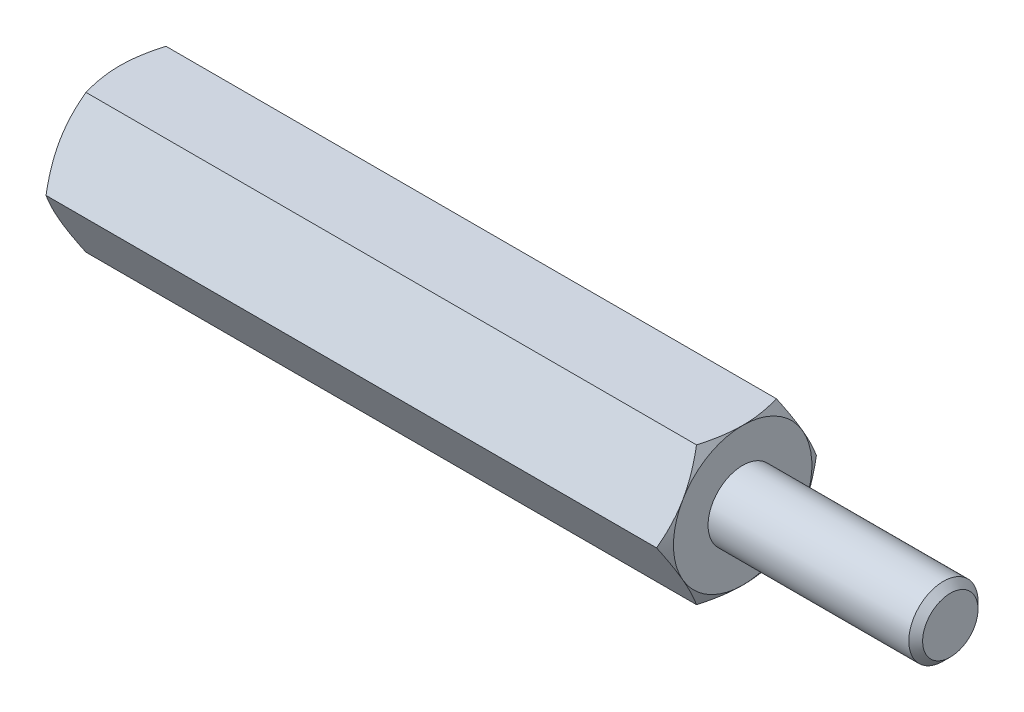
from build123d import *

# Parameters (mm, degrees)
EXTRUDE2_DEPTH = 9
SKETCH3_R      = 0.8
EXTRUDE3_DEPTH = 6
SKETCH5_R      = 1
EXTRUDE4_DEPTH = 6
CHAMFER1_SIZE  = 0.2


with BuildPart() as part:
    # Sketch1 → Extrude2 (new, symmetric)
    with BuildSketch(Plane(origin=(0, 0, 0), x_dir=(0, 0, -1), z_dir=(1, 0, 0))):
        Polygon((1.154700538, 2), (-1.154700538, 2), (-2.309401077, 0), (-1.154700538, -2), (1.154700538, -2), (2.309401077, 0), align=None)
    extrude(amount=EXTRUDE2_DEPTH, both=True)

    # Sketch2 → Cut-Revolve1 (revolve, cut)
    with BuildSketch(Plane.XY):
        with BuildLine():
            Line((-9, 2), (-7.5, 4.598076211))
            ThreePointArc((-7.5, 4.598076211), (-7.98810136, 5.776457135), (-9, 5))
            Line((-9, 5), (-9, 2))
        make_face()
    cut_revolve1 = revolve(axis=Axis((0, 0, 0), (1, 0, 0)), mode=Mode.SUBTRACT)

    # Mirror1: Cut-Revolve1 across plane
    add(cut_revolve1.mirror(Plane(origin=(0, 0, 0), x_dir=(0, 0, 1), z_dir=(1, 0, 0))), mode=Mode.SUBTRACT)

    # Sketch3 → Extrude3 (cut)
    with BuildSketch(Plane.ZY.offset(9)):
        Circle(SKETCH3_R)
    extrude(amount=-EXTRUDE3_DEPTH, mode=Mode.SUBTRACT)

    # Sketch4 → Cut-Revolve2 (revolve, cut)
    with BuildSketch(Plane.XY, mode=Mode.PRIVATE) as cut_revolve2_sk:
        Polygon((-3, 0), (-3, 0.8), (-2.538119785, 0), align=None)
    revolve(cut_revolve2_sk.sketch.rotate(Axis((-2.538119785, 0, 0), (-1, 0, 0)), 180), axis=Axis((-2.538119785, 0, 0), (-1, 0, 0)), mode=Mode.SUBTRACT)

    # Sketch5 → Extrude4 (add)
    with BuildSketch(Plane(origin=(9, 0, 0), x_dir=(0, 0, -1), z_dir=(1, 0, 0))):
        Circle(SKETCH5_R)
    extrude(amount=EXTRUDE4_DEPTH)

    # Chamfer1
    chamfer1_edges = [part.edges().sort_by_distance(p)[0] for p in [
        (15, 0, 1),
    ]]
    chamfer(chamfer1_edges, length=CHAMFER1_SIZE)


solid = part.part
